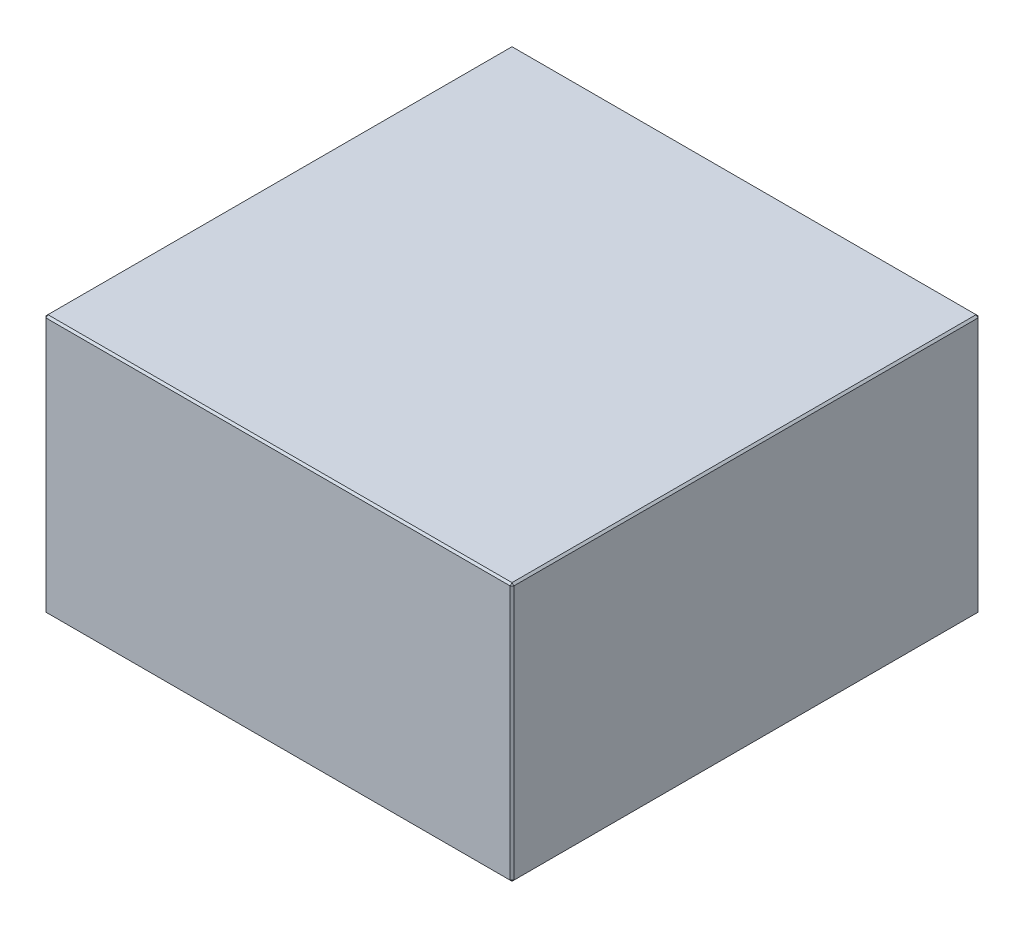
ISO-10303-21;
HEADER;
FILE_DESCRIPTION(('STEP AP214'),'2;1');
FILE_NAME('part.step','',(''),(''),'','','');
FILE_SCHEMA(('AUTOMOTIVE_DESIGN { 1 0 10303 214 1 1 1 1 }'));
ENDSEC;
DATA;
#1=APPLICATION_CONTEXT('core data for automotive mechanical design processes');
#2=APPLICATION_PROTOCOL_DEFINITION('international standard','automotive_design',2000,#1);
#3=PRODUCT_CONTEXT('',#1,'mechanical');
#4=PRODUCT('Part','Part','',(#3));
#5=PRODUCT_RELATED_PRODUCT_CATEGORY('part','',(#4));
#6=PRODUCT_DEFINITION_FORMATION('','',#4);
#7=PRODUCT_DEFINITION_CONTEXT('part definition',#1,'design');
#8=PRODUCT_DEFINITION('design','',#6,#7);
#9=PRODUCT_DEFINITION_SHAPE('','',#8);
#10=(LENGTH_UNIT() NAMED_UNIT(*) SI_UNIT(.MILLI.,.METRE.));
#11=(NAMED_UNIT(*) PLANE_ANGLE_UNIT() SI_UNIT($,.RADIAN.));
#12=(NAMED_UNIT(*) SI_UNIT($,.STERADIAN.) SOLID_ANGLE_UNIT());
#13=UNCERTAINTY_MEASURE_WITH_UNIT(LENGTH_MEASURE(1.E-05),#10,'distance_accuracy_value','');
#14=(GEOMETRIC_REPRESENTATION_CONTEXT(3) GLOBAL_UNCERTAINTY_ASSIGNED_CONTEXT((#13)) GLOBAL_UNIT_ASSIGNED_CONTEXT((#10,
#11,#12)) REPRESENTATION_CONTEXT('',''));
#15=CARTESIAN_POINT('',(0.,0.,0.));
#16=DIRECTION('',(0.,0.,1.));
#17=DIRECTION('',(1.,0.,0.));
#18=AXIS2_PLACEMENT_3D('',#15,#16,#17);
#19=CARTESIAN_POINT('',(-123.,136.,123.));
#20=DIRECTION('',(1.,0.,0.));
#21=DIRECTION('',(0.,0.,-1.));
#22=AXIS2_PLACEMENT_3D('',#19,#20,#21);
#23=PLANE('',#22);
#24=DIRECTION('',(0.,-1.,0.));
#25=VECTOR('',#24,1.);
#26=CARTESIAN_POINT('',(-123.,136.,-122.));
#27=LINE('',#26,#25);
#28=CARTESIAN_POINT('',(-123.,135.,-122.));
#29=VERTEX_POINT('',#28);
#30=CARTESIAN_POINT('',(-123.,1.,-122.));
#31=VERTEX_POINT('',#30);
#32=EDGE_CURVE('E115',#29,#31,#27,.T.);
#33=ORIENTED_EDGE('',*,*,#32,.T.);
#34=DIRECTION('',(0.,0.,1.));
#35=VECTOR('',#34,1.);
#36=CARTESIAN_POINT('',(-123.,1.,123.));
#37=LINE('',#36,#35);
#38=CARTESIAN_POINT('',(-123.,1.,122.));
#39=VERTEX_POINT('',#38);
#40=EDGE_CURVE('E111',#31,#39,#37,.T.);
#41=ORIENTED_EDGE('',*,*,#40,.T.);
#42=DIRECTION('',(0.,1.,0.));
#43=VECTOR('',#42,1.);
#44=CARTESIAN_POINT('',(-123.,136.,122.));
#45=LINE('',#44,#43);
#46=CARTESIAN_POINT('',(-123.,135.,122.));
#47=VERTEX_POINT('',#46);
#48=EDGE_CURVE('E104',#39,#47,#45,.T.);
#49=ORIENTED_EDGE('',*,*,#48,.T.);
#50=DIRECTION('',(0.,0.,-1.));
#51=VECTOR('',#50,1.);
#52=CARTESIAN_POINT('',(-123.,135.,-123.));
#53=LINE('',#52,#51);
#54=EDGE_CURVE('E108',#47,#29,#53,.T.);
#55=ORIENTED_EDGE('',*,*,#54,.T.);
#56=EDGE_LOOP('',(#33,#41,#49,#55));
#57=FACE_BOUND('',#56,.T.);
#58=ADVANCED_FACE('F16',(#57),#23,.F.);
#59=CARTESIAN_POINT('',(123.,136.,123.));
#60=DIRECTION('',(0.,0.,-1.));
#61=DIRECTION('',(-1.,0.,0.));
#62=AXIS2_PLACEMENT_3D('',#59,#60,#61);
#63=PLANE('',#62);
#64=DIRECTION('',(-1.,0.,0.));
#65=VECTOR('',#64,1.);
#66=CARTESIAN_POINT('',(-123.,135.,123.));
#67=LINE('',#66,#65);
#68=CARTESIAN_POINT('',(122.,135.,123.));
#69=VERTEX_POINT('',#68);
#70=CARTESIAN_POINT('',(-122.,135.,123.));
#71=VERTEX_POINT('',#70);
#72=EDGE_CURVE('E165',#69,#71,#67,.T.);
#73=ORIENTED_EDGE('',*,*,#72,.T.);
#74=DIRECTION('',(0.,-1.,0.));
#75=VECTOR('',#74,1.);
#76=CARTESIAN_POINT('',(-122.,136.,123.));
#77=LINE('',#76,#75);
#78=CARTESIAN_POINT('',(-122.,0.999999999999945,123.));
#79=VERTEX_POINT('',#78);
#80=EDGE_CURVE('E123',#71,#79,#77,.T.);
#81=ORIENTED_EDGE('',*,*,#80,.T.);
#82=DIRECTION('',(1.,0.,0.));
#83=VECTOR('',#82,1.);
#84=CARTESIAN_POINT('',(123.,0.999999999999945,123.));
#85=LINE('',#84,#83);
#86=CARTESIAN_POINT('',(122.,0.999999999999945,123.));
#87=VERTEX_POINT('',#86);
#88=EDGE_CURVE('E169',#79,#87,#85,.T.);
#89=ORIENTED_EDGE('',*,*,#88,.T.);
#90=DIRECTION('',(0.,1.,0.));
#91=VECTOR('',#90,1.);
#92=CARTESIAN_POINT('',(122.,136.,123.));
#93=LINE('',#92,#91);
#94=EDGE_CURVE('E167',#87,#69,#93,.T.);
#95=ORIENTED_EDGE('',*,*,#94,.T.);
#96=EDGE_LOOP('',(#73,#81,#89,#95));
#97=FACE_BOUND('',#96,.T.);
#98=ADVANCED_FACE('F276',(#97),#63,.F.);
#99=CARTESIAN_POINT('',(123.,136.,123.));
#100=DIRECTION('',(-1.,0.,0.));
#101=DIRECTION('',(0.,0.,1.));
#102=AXIS2_PLACEMENT_3D('',#99,#100,#101);
#103=PLANE('',#102);
#104=DIRECTION('',(0.,0.,-1.));
#105=VECTOR('',#104,1.);
#106=CARTESIAN_POINT('',(123.,0.999999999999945,123.));
#107=LINE('',#106,#105);
#108=CARTESIAN_POINT('',(123.,0.999999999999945,122.));
#109=VERTEX_POINT('',#108);
#110=CARTESIAN_POINT('',(123.,0.999999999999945,-122.));
#111=VERTEX_POINT('',#110);
#112=EDGE_CURVE('E160',#109,#111,#107,.T.);
#113=ORIENTED_EDGE('',*,*,#112,.T.);
#114=DIRECTION('',(0.,1.,0.));
#115=VECTOR('',#114,1.);
#116=CARTESIAN_POINT('',(123.,136.,-122.));
#117=LINE('',#116,#115);
#118=CARTESIAN_POINT('',(123.,135.,-122.));
#119=VERTEX_POINT('',#118);
#120=EDGE_CURVE('E162',#111,#119,#117,.T.);
#121=ORIENTED_EDGE('',*,*,#120,.T.);
#122=DIRECTION('',(0.,0.,1.));
#123=VECTOR('',#122,1.);
#124=CARTESIAN_POINT('',(123.,135.,123.));
#125=LINE('',#124,#123);
#126=CARTESIAN_POINT('',(123.,135.,122.));
#127=VERTEX_POINT('',#126);
#128=EDGE_CURVE('E156',#119,#127,#125,.T.);
#129=ORIENTED_EDGE('',*,*,#128,.T.);
#130=DIRECTION('',(0.,-1.,0.));
#131=VECTOR('',#130,1.);
#132=CARTESIAN_POINT('',(123.,136.,122.));
#133=LINE('',#132,#131);
#134=EDGE_CURVE('E158',#127,#109,#133,.T.);
#135=ORIENTED_EDGE('',*,*,#134,.T.);
#136=EDGE_LOOP('',(#113,#121,#129,#135));
#137=FACE_BOUND('',#136,.T.);
#138=ADVANCED_FACE('F255',(#137),#103,.F.);
#139=CARTESIAN_POINT('',(123.,136.,-123.));
#140=DIRECTION('',(0.,0.,1.));
#141=DIRECTION('',(1.,0.,0.));
#142=AXIS2_PLACEMENT_3D('',#139,#140,#141);
#143=PLANE('',#142);
#144=DIRECTION('',(0.,-1.,0.));
#145=VECTOR('',#144,1.);
#146=CARTESIAN_POINT('',(122.,136.,-123.));
#147=LINE('',#146,#145);
#148=CARTESIAN_POINT('',(122.,135.,-123.));
#149=VERTEX_POINT('',#148);
#150=CARTESIAN_POINT('',(122.,0.999999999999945,-123.));
#151=VERTEX_POINT('',#150);
#152=EDGE_CURVE('E149',#149,#151,#147,.T.);
#153=ORIENTED_EDGE('',*,*,#152,.T.);
#154=DIRECTION('',(-1.,0.,0.));
#155=VECTOR('',#154,1.);
#156=CARTESIAN_POINT('',(123.,0.999999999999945,-123.));
#157=LINE('',#156,#155);
#158=CARTESIAN_POINT('',(-122.,0.999999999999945,-123.));
#159=VERTEX_POINT('',#158);
#160=EDGE_CURVE('E154',#151,#159,#157,.T.);
#161=ORIENTED_EDGE('',*,*,#160,.T.);
#162=DIRECTION('',(0.,1.,0.));
#163=VECTOR('',#162,1.);
#164=CARTESIAN_POINT('',(-122.,136.,-123.));
#165=LINE('',#164,#163);
#166=CARTESIAN_POINT('',(-122.,135.,-123.));
#167=VERTEX_POINT('',#166);
#168=EDGE_CURVE('E151',#159,#167,#165,.T.);
#169=ORIENTED_EDGE('',*,*,#168,.T.);
#170=DIRECTION('',(1.,0.,0.));
#171=VECTOR('',#170,1.);
#172=CARTESIAN_POINT('',(123.,135.,-123.));
#173=LINE('',#172,#171);
#174=EDGE_CURVE('E147',#167,#149,#173,.T.);
#175=ORIENTED_EDGE('',*,*,#174,.T.);
#176=EDGE_LOOP('',(#153,#161,#169,#175));
#177=FACE_BOUND('',#176,.T.);
#178=ADVANCED_FACE('F285',(#177),#143,.F.);
#179=CARTESIAN_POINT('',(0.,136.,0.));
#180=DIRECTION('',(0.,1.,0.));
#181=DIRECTION('',(0.,0.,1.));
#182=AXIS2_PLACEMENT_3D('',#179,#180,#181);
#183=PLANE('',#182);
#184=DIRECTION('',(0.,0.,-1.));
#185=VECTOR('',#184,1.);
#186=CARTESIAN_POINT('',(122.,136.,-123.));
#187=LINE('',#186,#185);
#188=CARTESIAN_POINT('',(122.,136.,122.));
#189=VERTEX_POINT('',#188);
#190=CARTESIAN_POINT('',(122.,136.,-122.));
#191=VERTEX_POINT('',#190);
#192=EDGE_CURVE('E25',#189,#191,#187,.T.);
#193=ORIENTED_EDGE('',*,*,#192,.T.);
#194=DIRECTION('',(-1.,0.,0.));
#195=VECTOR('',#194,1.);
#196=CARTESIAN_POINT('',(-123.,136.,-122.));
#197=LINE('',#196,#195);
#198=CARTESIAN_POINT('',(-122.,136.,-122.));
#199=VERTEX_POINT('',#198);
#200=EDGE_CURVE('E10',#191,#199,#197,.T.);
#201=ORIENTED_EDGE('',*,*,#200,.T.);
#202=DIRECTION('',(0.,0.,1.));
#203=VECTOR('',#202,1.);
#204=CARTESIAN_POINT('',(-122.,136.,123.));
#205=LINE('',#204,#203);
#206=CARTESIAN_POINT('',(-122.,136.,122.));
#207=VERTEX_POINT('',#206);
#208=EDGE_CURVE('E181',#199,#207,#205,.T.);
#209=ORIENTED_EDGE('',*,*,#208,.T.);
#210=DIRECTION('',(1.,0.,0.));
#211=VECTOR('',#210,1.);
#212=CARTESIAN_POINT('',(123.,136.,122.));
#213=LINE('',#212,#211);
#214=EDGE_CURVE('E36',#207,#189,#213,.T.);
#215=ORIENTED_EDGE('',*,*,#214,.T.);
#216=EDGE_LOOP('',(#193,#201,#209,#215));
#217=FACE_BOUND('',#216,.T.);
#218=ADVANCED_FACE('F351',(#217),#183,.T.);
#219=CARTESIAN_POINT('',(0.,0.,0.));
#220=DIRECTION('',(0.,1.,0.));
#221=DIRECTION('',(0.,0.,1.));
#222=AXIS2_PLACEMENT_3D('',#219,#220,#221);
#223=PLANE('',#222);
#224=DIRECTION('',(0.,0.,1.));
#225=VECTOR('',#224,1.);
#226=CARTESIAN_POINT('',(122.,0.,0.));
#227=LINE('',#226,#225);
#228=CARTESIAN_POINT('',(122.,0.,-122.));
#229=VERTEX_POINT('',#228);
#230=CARTESIAN_POINT('',(122.,0.,122.));
#231=VERTEX_POINT('',#230);
#232=EDGE_CURVE('E172',#229,#231,#227,.T.);
#233=ORIENTED_EDGE('',*,*,#232,.T.);
#234=DIRECTION('',(-1.,0.,0.));
#235=VECTOR('',#234,1.);
#236=CARTESIAN_POINT('',(0.,0.,122.));
#237=LINE('',#236,#235);
#238=CARTESIAN_POINT('',(-122.,0.,122.));
#239=VERTEX_POINT('',#238);
#240=EDGE_CURVE('E178',#231,#239,#237,.T.);
#241=ORIENTED_EDGE('',*,*,#240,.T.);
#242=DIRECTION('',(0.,0.,-1.));
#243=VECTOR('',#242,1.);
#244=CARTESIAN_POINT('',(-122.,0.,0.));
#245=LINE('',#244,#243);
#246=CARTESIAN_POINT('',(-122.,0.,-122.));
#247=VERTEX_POINT('',#246);
#248=EDGE_CURVE('E176',#239,#247,#245,.T.);
#249=ORIENTED_EDGE('',*,*,#248,.T.);
#250=DIRECTION('',(1.,0.,0.));
#251=VECTOR('',#250,1.);
#252=CARTESIAN_POINT('',(0.,0.,-122.));
#253=LINE('',#252,#251);
#254=EDGE_CURVE('E174',#247,#229,#253,.T.);
#255=ORIENTED_EDGE('',*,*,#254,.T.);
#256=EDGE_LOOP('',(#233,#241,#249,#255));
#257=FACE_BOUND('',#256,.T.);
#258=ADVANCED_FACE('F247',(#257),#223,.F.);
#259=CARTESIAN_POINT('',(123.,136.,122.));
#260=DIRECTION('',(-0.707106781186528,0.,-0.707106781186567));
#261=DIRECTION('',(0.,-1.,0.));
#262=AXIS2_PLACEMENT_3D('',#259,#260,#261);
#263=PLANE('',#262);
#264=DIRECTION('',(-0.707106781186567,0.,0.707106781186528));
#265=VECTOR('',#264,1.);
#266=CARTESIAN_POINT('',(122.,135.,123.));
#267=LINE('',#266,#265);
#268=EDGE_CURVE('E20',#69,#127,#267,.F.);
#269=ORIENTED_EDGE('',*,*,#268,.F.);
#270=ORIENTED_EDGE('',*,*,#94,.F.);
#271=DIRECTION('',(0.707106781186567,0.,-0.707106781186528));
#272=VECTOR('',#271,1.);
#273=CARTESIAN_POINT('',(122.,0.999999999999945,123.));
#274=LINE('',#273,#272);
#275=EDGE_CURVE('E143',#109,#87,#274,.F.);
#276=ORIENTED_EDGE('',*,*,#275,.F.);
#277=ORIENTED_EDGE('',*,*,#134,.F.);
#278=EDGE_LOOP('',(#269,#270,#276,#277));
#279=FACE_BOUND('',#278,.T.);
#280=ADVANCED_FACE('F18',(#279),#263,.F.);
#281=CARTESIAN_POINT('',(122.,135.,123.));
#282=DIRECTION('',(0.577350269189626,0.577350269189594,0.577350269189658));
#283=DIRECTION('',(0.707106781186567,0.,-0.707106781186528));
#284=AXIS2_PLACEMENT_3D('',#281,#282,#283);
#285=PLANE('',#284);
#286=DIRECTION('',(0.,-0.707106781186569,0.707106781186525));
#287=VECTOR('',#286,1.);
#288=CARTESIAN_POINT('',(122.,135.,123.));
#289=LINE('',#288,#287);
#290=EDGE_CURVE('E227',#69,#189,#289,.F.);
#291=ORIENTED_EDGE('',*,*,#290,.F.);
#292=ORIENTED_EDGE('',*,*,#268,.T.);
#293=DIRECTION('',(-0.707106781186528,0.707106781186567,0.));
#294=VECTOR('',#293,1.);
#295=CARTESIAN_POINT('',(122.5,135.5,122.));
#296=LINE('',#295,#294);
#297=EDGE_CURVE('E229',#189,#127,#296,.F.);
#298=ORIENTED_EDGE('',*,*,#297,.F.);
#299=EDGE_LOOP('',(#291,#292,#298));
#300=FACE_BOUND('',#299,.T.);
#301=ADVANCED_FACE('F271',(#300),#285,.T.);
#302=CARTESIAN_POINT('',(122.,0.999999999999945,123.));
#303=DIRECTION('',(0.577350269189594,-0.577350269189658,0.577350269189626));
#304=DIRECTION('',(0.,-0.707106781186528,-0.707106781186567));
#305=AXIS2_PLACEMENT_3D('',#302,#303,#304);
#306=PLANE('',#305);
#307=DIRECTION('',(-0.707106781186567,-0.707106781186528,0.));
#308=VECTOR('',#307,1.);
#309=CARTESIAN_POINT('',(122.5,0.499999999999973,122.));
#310=LINE('',#309,#308);
#311=EDGE_CURVE('E221',#109,#231,#310,.T.);
#312=ORIENTED_EDGE('',*,*,#311,.F.);
#313=ORIENTED_EDGE('',*,*,#275,.T.);
#314=DIRECTION('',(0.,0.70710678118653,0.707106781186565));
#315=VECTOR('',#314,1.);
#316=CARTESIAN_POINT('',(122.,0.999999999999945,123.));
#317=LINE('',#316,#315);
#318=EDGE_CURVE('E224',#231,#87,#317,.T.);
#319=ORIENTED_EDGE('',*,*,#318,.F.);
#320=EDGE_LOOP('',(#312,#313,#319));
#321=FACE_BOUND('',#320,.T.);
#322=ADVANCED_FACE('F236',(#321),#306,.T.);
#323=CARTESIAN_POINT('',(122.,136.,0.));
#324=DIRECTION('',(0.707106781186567,0.707106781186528,0.));
#325=DIRECTION('',(0.,0.,1.));
#326=AXIS2_PLACEMENT_3D('',#323,#324,#325);
#327=PLANE('',#326);
#328=ORIENTED_EDGE('',*,*,#297,.T.);
#329=ORIENTED_EDGE('',*,*,#128,.F.);
#330=DIRECTION('',(0.707106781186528,-0.707106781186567,0.));
#331=VECTOR('',#330,1.);
#332=CARTESIAN_POINT('',(123.,135.,-122.));
#333=LINE('',#332,#331);
#334=EDGE_CURVE('E216',#191,#119,#333,.T.);
#335=ORIENTED_EDGE('',*,*,#334,.F.);
#336=ORIENTED_EDGE('',*,*,#192,.F.);
#337=EDGE_LOOP('',(#328,#329,#335,#336));
#338=FACE_BOUND('',#337,.T.);
#339=ADVANCED_FACE('F266',(#338),#327,.T.);
#340=CARTESIAN_POINT('',(0.,136.,122.));
#341=DIRECTION('',(0.,0.707106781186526,0.70710678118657));
#342=DIRECTION('',(-1.,0.,0.));
#343=AXIS2_PLACEMENT_3D('',#340,#341,#342);
#344=PLANE('',#343);
#345=ORIENTED_EDGE('',*,*,#290,.T.);
#346=ORIENTED_EDGE('',*,*,#214,.F.);
#347=DIRECTION('',(0.,0.70710678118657,-0.707106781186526));
#348=VECTOR('',#347,1.);
#349=CARTESIAN_POINT('',(-122.,135.5,122.5));
#350=LINE('',#349,#348);
#351=EDGE_CURVE('E127',#71,#207,#350,.T.);
#352=ORIENTED_EDGE('',*,*,#351,.F.);
#353=ORIENTED_EDGE('',*,*,#72,.F.);
#354=EDGE_LOOP('',(#345,#346,#352,#353));
#355=FACE_BOUND('',#354,.T.);
#356=ADVANCED_FACE('F274',(#355),#344,.T.);
#357=CARTESIAN_POINT('',(-122.,136.,123.));
#358=DIRECTION('',(0.707106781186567,0.,-0.707106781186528));
#359=DIRECTION('',(0.,-1.,0.));
#360=AXIS2_PLACEMENT_3D('',#357,#358,#359);
#361=PLANE('',#360);
#362=DIRECTION('',(0.707106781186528,0.,0.707106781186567));
#363=VECTOR('',#362,1.);
#364=CARTESIAN_POINT('',(-122.,0.999999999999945,123.));
#365=LINE('',#364,#363);
#366=EDGE_CURVE('E128',#79,#39,#365,.F.);
#367=ORIENTED_EDGE('',*,*,#366,.F.);
#368=ORIENTED_EDGE('',*,*,#80,.F.);
#369=DIRECTION('',(-0.707106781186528,0.,-0.707106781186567));
#370=VECTOR('',#369,1.);
#371=CARTESIAN_POINT('',(-123.,135.,122.));
#372=LINE('',#371,#370);
#373=EDGE_CURVE('E119',#47,#71,#372,.F.);
#374=ORIENTED_EDGE('',*,*,#373,.F.);
#375=ORIENTED_EDGE('',*,*,#48,.F.);
#376=EDGE_LOOP('',(#367,#368,#374,#375));
#377=FACE_BOUND('',#376,.T.);
#378=ADVANCED_FACE('F121',(#377),#361,.F.);
#379=CARTESIAN_POINT('',(123.,0.999999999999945,123.));
#380=DIRECTION('',(0.,0.707106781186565,-0.70710678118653));
#381=DIRECTION('',(1.,0.,0.));
#382=AXIS2_PLACEMENT_3D('',#379,#380,#381);
#383=PLANE('',#382);
#384=ORIENTED_EDGE('',*,*,#318,.T.);
#385=ORIENTED_EDGE('',*,*,#88,.F.);
#386=DIRECTION('',(0.,-0.70710678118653,-0.707106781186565));
#387=VECTOR('',#386,1.);
#388=CARTESIAN_POINT('',(-122.,0.999999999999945,123.));
#389=LINE('',#388,#387);
#390=EDGE_CURVE('E212',#239,#79,#389,.F.);
#391=ORIENTED_EDGE('',*,*,#390,.F.);
#392=ORIENTED_EDGE('',*,*,#240,.F.);
#393=EDGE_LOOP('',(#384,#385,#391,#392));
#394=FACE_BOUND('',#393,.T.);
#395=ADVANCED_FACE('F244',(#394),#383,.F.);
#396=CARTESIAN_POINT('',(123.,0.999999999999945,123.));
#397=DIRECTION('',(-0.707106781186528,0.707106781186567,0.));
#398=DIRECTION('',(0.,0.,-1.));
#399=AXIS2_PLACEMENT_3D('',#396,#397,#398);
#400=PLANE('',#399);
#401=ORIENTED_EDGE('',*,*,#311,.T.);
#402=ORIENTED_EDGE('',*,*,#232,.F.);
#403=DIRECTION('',(0.707106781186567,0.707106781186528,0.));
#404=VECTOR('',#403,1.);
#405=CARTESIAN_POINT('',(122.5,0.499999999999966,-122.));
#406=LINE('',#405,#404);
#407=EDGE_CURVE('E209',#111,#229,#406,.F.);
#408=ORIENTED_EDGE('',*,*,#407,.F.);
#409=ORIENTED_EDGE('',*,*,#112,.F.);
#410=EDGE_LOOP('',(#401,#402,#408,#409));
#411=FACE_BOUND('',#410,.T.);
#412=ADVANCED_FACE('F252',(#411),#400,.F.);
#413=CARTESIAN_POINT('',(122.,136.,-123.));
#414=DIRECTION('',(-0.707106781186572,0.,0.707106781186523));
#415=DIRECTION('',(0.,-1.,0.));
#416=AXIS2_PLACEMENT_3D('',#413,#414,#415);
#417=PLANE('',#416);
#418=DIRECTION('',(0.707106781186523,0.,0.707106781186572));
#419=VECTOR('',#418,1.);
#420=CARTESIAN_POINT('',(123.,135.,-122.));
#421=LINE('',#420,#419);
#422=EDGE_CURVE('E218',#119,#149,#421,.F.);
#423=ORIENTED_EDGE('',*,*,#422,.F.);
#424=ORIENTED_EDGE('',*,*,#120,.F.);
#425=DIRECTION('',(-0.707106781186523,0.,-0.707106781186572));
#426=VECTOR('',#425,1.);
#427=CARTESIAN_POINT('',(122.,0.999999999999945,-123.));
#428=LINE('',#427,#426);
#429=EDGE_CURVE('E206',#151,#111,#428,.F.);
#430=ORIENTED_EDGE('',*,*,#429,.F.);
#431=ORIENTED_EDGE('',*,*,#152,.F.);
#432=EDGE_LOOP('',(#423,#424,#430,#431));
#433=FACE_BOUND('',#432,.T.);
#434=ADVANCED_FACE('F259',(#433),#417,.F.);
#435=CARTESIAN_POINT('',(123.,135.,-122.));
#436=DIRECTION('',(0.577350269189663,0.577350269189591,-0.577350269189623));
#437=DIRECTION('',(-0.707106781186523,0.,-0.707106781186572));
#438=AXIS2_PLACEMENT_3D('',#435,#436,#437);
#439=PLANE('',#438);
#440=ORIENTED_EDGE('',*,*,#334,.T.);
#441=ORIENTED_EDGE('',*,*,#422,.T.);
#442=DIRECTION('',(0.,0.70710678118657,0.707106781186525));
#443=VECTOR('',#442,1.);
#444=CARTESIAN_POINT('',(122.,135.5,-122.5));
#445=LINE('',#444,#443);
#446=EDGE_CURVE('E135',#191,#149,#445,.F.);
#447=ORIENTED_EDGE('',*,*,#446,.F.);
#448=EDGE_LOOP('',(#440,#441,#447));
#449=FACE_BOUND('',#448,.T.);
#450=ADVANCED_FACE('F326',(#449),#439,.T.);
#451=CARTESIAN_POINT('',(-123.,135.,122.));
#452=DIRECTION('',(-0.577350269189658,0.577350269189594,0.577350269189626));
#453=DIRECTION('',(0.707106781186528,0.,0.707106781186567));
#454=AXIS2_PLACEMENT_3D('',#451,#452,#453);
#455=PLANE('',#454);
#456=ORIENTED_EDGE('',*,*,#373,.T.);
#457=ORIENTED_EDGE('',*,*,#351,.T.);
#458=DIRECTION('',(-0.707106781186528,-0.707106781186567,0.));
#459=VECTOR('',#458,1.);
#460=CARTESIAN_POINT('',(-123.,135.,122.));
#461=LINE('',#460,#459);
#462=EDGE_CURVE('E131',#47,#207,#461,.F.);
#463=ORIENTED_EDGE('',*,*,#462,.F.);
#464=EDGE_LOOP('',(#456,#457,#463));
#465=FACE_BOUND('',#464,.T.);
#466=ADVANCED_FACE('F132',(#465),#455,.T.);
#467=CARTESIAN_POINT('',(-122.,0.999999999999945,123.));
#468=DIRECTION('',(-0.577350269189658,-0.577350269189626,0.577350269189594));
#469=DIRECTION('',(0.707106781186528,-0.707106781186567,0.));
#470=AXIS2_PLACEMENT_3D('',#467,#468,#469);
#471=PLANE('',#470);
#472=ORIENTED_EDGE('',*,*,#390,.T.);
#473=ORIENTED_EDGE('',*,*,#366,.T.);
#474=DIRECTION('',(-0.707106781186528,0.707106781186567,0.));
#475=VECTOR('',#474,1.);
#476=CARTESIAN_POINT('',(-122.5,0.5,122.));
#477=LINE('',#476,#475);
#478=EDGE_CURVE('E136',#239,#39,#477,.T.);
#479=ORIENTED_EDGE('',*,*,#478,.F.);
#480=EDGE_LOOP('',(#472,#473,#479));
#481=FACE_BOUND('',#480,.T.);
#482=ADVANCED_FACE('F319',(#481),#471,.T.);
#483=CARTESIAN_POINT('',(122.,0.999999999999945,-123.));
#484=DIRECTION('',(0.577350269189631,-0.577350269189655,-0.577350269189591));
#485=DIRECTION('',(0.707106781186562,0.707106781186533,0.));
#486=AXIS2_PLACEMENT_3D('',#483,#484,#485);
#487=PLANE('',#486);
#488=ORIENTED_EDGE('',*,*,#429,.T.);
#489=ORIENTED_EDGE('',*,*,#407,.T.);
#490=DIRECTION('',(0.,-0.70710678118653,0.707106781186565));
#491=VECTOR('',#490,1.);
#492=CARTESIAN_POINT('',(122.,0.999999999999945,-123.));
#493=LINE('',#492,#491);
#494=EDGE_CURVE('E199',#151,#229,#493,.T.);
#495=ORIENTED_EDGE('',*,*,#494,.F.);
#496=EDGE_LOOP('',(#488,#489,#495));
#497=FACE_BOUND('',#496,.T.);
#498=ADVANCED_FACE('F315',(#497),#487,.T.);
#499=CARTESIAN_POINT('',(0.,136.,-122.));
#500=DIRECTION('',(0.,0.707106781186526,-0.70710678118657));
#501=DIRECTION('',(1.,0.,0.));
#502=AXIS2_PLACEMENT_3D('',#499,#500,#501);
#503=PLANE('',#502);
#504=ORIENTED_EDGE('',*,*,#446,.T.);
#505=ORIENTED_EDGE('',*,*,#174,.F.);
#506=DIRECTION('',(0.,-0.707106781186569,-0.707106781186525));
#507=VECTOR('',#506,1.);
#508=CARTESIAN_POINT('',(-122.,135.,-123.));
#509=LINE('',#508,#507);
#510=EDGE_CURVE('E196',#199,#167,#509,.T.);
#511=ORIENTED_EDGE('',*,*,#510,.F.);
#512=ORIENTED_EDGE('',*,*,#200,.F.);
#513=EDGE_LOOP('',(#504,#505,#511,#512));
#514=FACE_BOUND('',#513,.T.);
#515=ADVANCED_FACE('F312',(#514),#503,.T.);
#516=CARTESIAN_POINT('',(-122.,136.,0.));
#517=DIRECTION('',(-0.707106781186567,0.707106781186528,0.));
#518=DIRECTION('',(0.,0.,-1.));
#519=AXIS2_PLACEMENT_3D('',#516,#517,#518);
#520=PLANE('',#519);
#521=ORIENTED_EDGE('',*,*,#462,.T.);
#522=ORIENTED_EDGE('',*,*,#208,.F.);
#523=DIRECTION('',(0.707106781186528,0.707106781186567,0.));
#524=VECTOR('',#523,1.);
#525=CARTESIAN_POINT('',(-122.5,135.5,-122.));
#526=LINE('',#525,#524);
#527=EDGE_CURVE('E139',#29,#199,#526,.T.);
#528=ORIENTED_EDGE('',*,*,#527,.F.);
#529=ORIENTED_EDGE('',*,*,#54,.F.);
#530=EDGE_LOOP('',(#521,#522,#528,#529));
#531=FACE_BOUND('',#530,.T.);
#532=ADVANCED_FACE('F138',(#531),#520,.T.);
#533=CARTESIAN_POINT('',(-123.,1.,123.));
#534=DIRECTION('',(0.707106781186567,0.707106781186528,0.));
#535=DIRECTION('',(0.,0.,1.));
#536=AXIS2_PLACEMENT_3D('',#533,#534,#535);
#537=PLANE('',#536);
#538=ORIENTED_EDGE('',*,*,#478,.T.);
#539=ORIENTED_EDGE('',*,*,#40,.F.);
#540=DIRECTION('',(0.707106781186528,-0.707106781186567,0.));
#541=VECTOR('',#540,1.);
#542=CARTESIAN_POINT('',(-123.,1.,-122.));
#543=LINE('',#542,#541);
#544=EDGE_CURVE('E192',#247,#31,#543,.F.);
#545=ORIENTED_EDGE('',*,*,#544,.F.);
#546=ORIENTED_EDGE('',*,*,#248,.F.);
#547=EDGE_LOOP('',(#538,#539,#545,#546));
#548=FACE_BOUND('',#547,.T.);
#549=ADVANCED_FACE('F305',(#548),#537,.F.);
#550=CARTESIAN_POINT('',(123.,0.999999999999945,-123.));
#551=DIRECTION('',(0.,0.707106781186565,0.70710678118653));
#552=DIRECTION('',(-1.,0.,0.));
#553=AXIS2_PLACEMENT_3D('',#550,#551,#552);
#554=PLANE('',#553);
#555=ORIENTED_EDGE('',*,*,#494,.T.);
#556=ORIENTED_EDGE('',*,*,#254,.F.);
#557=DIRECTION('',(0.,0.70710678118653,-0.707106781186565));
#558=VECTOR('',#557,1.);
#559=CARTESIAN_POINT('',(-122.,0.499999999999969,-122.5));
#560=LINE('',#559,#558);
#561=EDGE_CURVE('E189',#159,#247,#560,.F.);
#562=ORIENTED_EDGE('',*,*,#561,.F.);
#563=ORIENTED_EDGE('',*,*,#160,.F.);
#564=EDGE_LOOP('',(#555,#556,#562,#563));
#565=FACE_BOUND('',#564,.T.);
#566=ADVANCED_FACE('F301',(#565),#554,.F.);
#567=CARTESIAN_POINT('',(-122.,135.,-123.));
#568=DIRECTION('',(-0.577350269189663,0.577350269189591,-0.577350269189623));
#569=DIRECTION('',(-0.707106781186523,0.,0.707106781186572));
#570=AXIS2_PLACEMENT_3D('',#567,#568,#569);
#571=PLANE('',#570);
#572=ORIENTED_EDGE('',*,*,#527,.T.);
#573=ORIENTED_EDGE('',*,*,#510,.T.);
#574=DIRECTION('',(0.707106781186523,0.,-0.707106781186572));
#575=VECTOR('',#574,1.);
#576=CARTESIAN_POINT('',(-122.,135.,-123.));
#577=LINE('',#576,#575);
#578=EDGE_CURVE('E187',#29,#167,#577,.T.);
#579=ORIENTED_EDGE('',*,*,#578,.F.);
#580=EDGE_LOOP('',(#572,#573,#579));
#581=FACE_BOUND('',#580,.T.);
#582=ADVANCED_FACE('F297',(#581),#571,.T.);
#583=CARTESIAN_POINT('',(-123.,1.,-122.));
#584=DIRECTION('',(-0.577350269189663,-0.577350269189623,-0.577350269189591));
#585=DIRECTION('',(0.707106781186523,-0.707106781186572,0.));
#586=AXIS2_PLACEMENT_3D('',#583,#584,#585);
#587=PLANE('',#586);
#588=ORIENTED_EDGE('',*,*,#561,.T.);
#589=ORIENTED_EDGE('',*,*,#544,.T.);
#590=DIRECTION('',(-0.707106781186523,0.,0.707106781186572));
#591=VECTOR('',#590,1.);
#592=CARTESIAN_POINT('',(-123.,1.,-122.));
#593=LINE('',#592,#591);
#594=EDGE_CURVE('E185',#159,#31,#593,.T.);
#595=ORIENTED_EDGE('',*,*,#594,.F.);
#596=EDGE_LOOP('',(#588,#589,#595));
#597=FACE_BOUND('',#596,.T.);
#598=ADVANCED_FACE('F293',(#597),#587,.T.);
#599=CARTESIAN_POINT('',(-123.,136.,-122.));
#600=DIRECTION('',(0.707106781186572,0.,0.707106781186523));
#601=DIRECTION('',(0.,-1.,0.));
#602=AXIS2_PLACEMENT_3D('',#599,#600,#601);
#603=PLANE('',#602);
#604=ORIENTED_EDGE('',*,*,#578,.T.);
#605=ORIENTED_EDGE('',*,*,#168,.F.);
#606=ORIENTED_EDGE('',*,*,#594,.T.);
#607=ORIENTED_EDGE('',*,*,#32,.F.);
#608=EDGE_LOOP('',(#604,#605,#606,#607));
#609=FACE_BOUND('',#608,.T.);
#610=ADVANCED_FACE('F290',(#609),#603,.F.);
#611=CLOSED_SHELL('',(#58,#98,#138,#178,#218,#258,#280,#301,#322,#339,#356,#378,#395,#412,#434,
#450,#466,#482,#498,#515,#532,#549,#566,#582,#598,#610));
#612=MANIFOLD_SOLID_BREP('B1',#611);
#613=ADVANCED_BREP_SHAPE_REPRESENTATION('',(#18,#612),#14);
#614=SHAPE_DEFINITION_REPRESENTATION(#9,#613);
ENDSEC;
END-ISO-10303-21;
